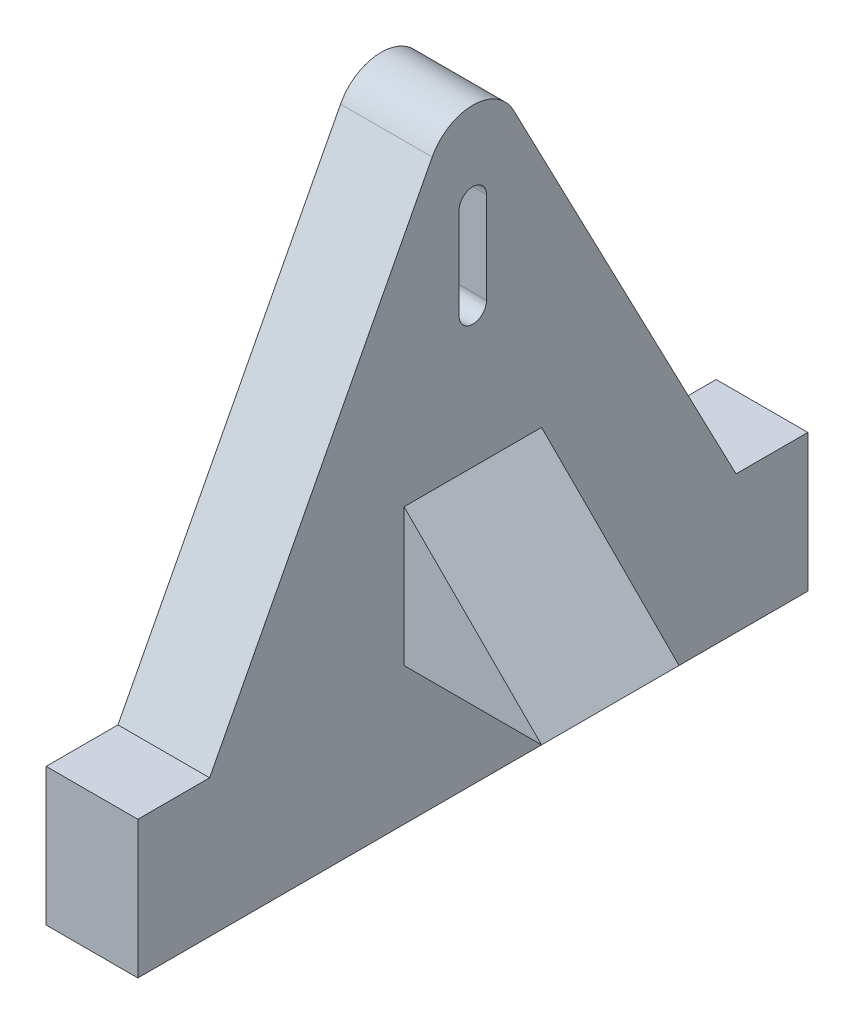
from build123d import *

# Parameters (mm, degrees)
BOSS_EXTRUDE1_DEPTH     = 30
SKETCH3_W               = 30
SKETCH3_H               = 146.199261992
BOSS_EXTRUDE2_DEPTH     = 30
CUT_EXTRUDE3_DEPTH      = 106.563043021
CUT_EXTRUDE3_DEPTH_BACK = 106.563043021
SKETCH4_W               = 30
SKETCH4_H               = 30
BOSS_EXTRUDE3_DEPTH     = 30
CUT_EXTRUDE4_DEPTH      = 128.520762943
CUT_EXTRUDE4_DEPTH_BACK = 128.520762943
CUT_EXTRUDE5_DEPTH      = 173.841615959
CUT_EXTRUDE5_DEPTH_BACK = 173.841615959
SKETCH6_W               = 10
SKETCH6_H               = 133.245058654


with BuildPart() as part:
    # Sketch1 → Boss-Extrude1 (new body)
    with BuildSketch(Plane(origin=(0, 0, 0), x_dir=(0, 0, -1), z_dir=(1, 0, 0))):
        with BuildLine():
            Line((-8.864389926, 53.02297053), (-73.099630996, -70))
            Line((-73.099630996, -70), (73.099630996, -70))
            Line((73.099630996, -70), (8.864389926, 53.02297053))
            ThreePointArc((8.864389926, 53.02297053), (0, 58.394516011), (-8.864389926, 53.02297053))
        make_face()
    extrude(amount=BOSS_EXTRUDE1_DEPTH)

    # Sketch3 → Boss-Extrude2 (add)
    with BuildSketch(Plane.XZ.offset(70)):
        with Locations((15, 0)):
            Rectangle(SKETCH3_W, SKETCH3_H)
    extrude(amount=-BOSS_EXTRUDE2_DEPTH)

    # Sketch2 → Cut-Extrude3 (cut, two sides: drawn at the far end of the back side and taken through both)
    with BuildSketch(Plane(origin=(30, 0, 0), x_dir=(0, 0, -1), z_dir=(1, 0, 0)).offset(-CUT_EXTRUDE3_DEPTH_BACK)):
        with BuildLine():
            Line((-3, 20), (-3, 40))
            ThreePointArc((-3, 40), (0, 43), (3, 40))
            Line((3, 40), (3, 20))
            ThreePointArc((3, 20), (0, 17), (-3, 20))
        make_face()
    extrude(amount=CUT_EXTRUDE3_DEPTH + CUT_EXTRUDE3_DEPTH_BACK, mode=Mode.SUBTRACT)

    # Sketch4 → Boss-Extrude3 (add)
    with BuildSketch(Plane(origin=(30, 0, 0), x_dir=(0, 0, -1), z_dir=(1, 0, 0))):
        with Locations((0, -25)):
            Rectangle(SKETCH4_W, SKETCH4_H)
    extrude(amount=BOSS_EXTRUDE3_DEPTH)

    # Sketch5 → Cut-Extrude4 (cut, two sides: drawn at the far end of the back side and taken through both)
    with BuildSketch(Plane(origin=(0, 0, -15), x_dir=(-1, 0, 0), z_dir=(0, 0, -1)).offset(-CUT_EXTRUDE4_DEPTH_BACK)):
        Polygon((-60, -40), (-30, -10), (-60, -10), align=None)
    extrude(amount=CUT_EXTRUDE4_DEPTH + CUT_EXTRUDE4_DEPTH_BACK, mode=Mode.SUBTRACT)

    # Sketch6 → Cut-Extrude5 (cut, two sides: drawn at the far end of the back side and taken through both)
    with BuildSketch(Plane(origin=(0, 0, -73.099630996), x_dir=(-1, 0, 0), z_dir=(0, 0, -1)).offset(-CUT_EXTRUDE5_DEPTH_BACK)):
        with Locations((-5, -3.377470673)):
            Rectangle(SKETCH6_W, SKETCH6_H)
    extrude(amount=CUT_EXTRUDE5_DEPTH + CUT_EXTRUDE5_DEPTH_BACK, mode=Mode.SUBTRACT)


solid = part.part
